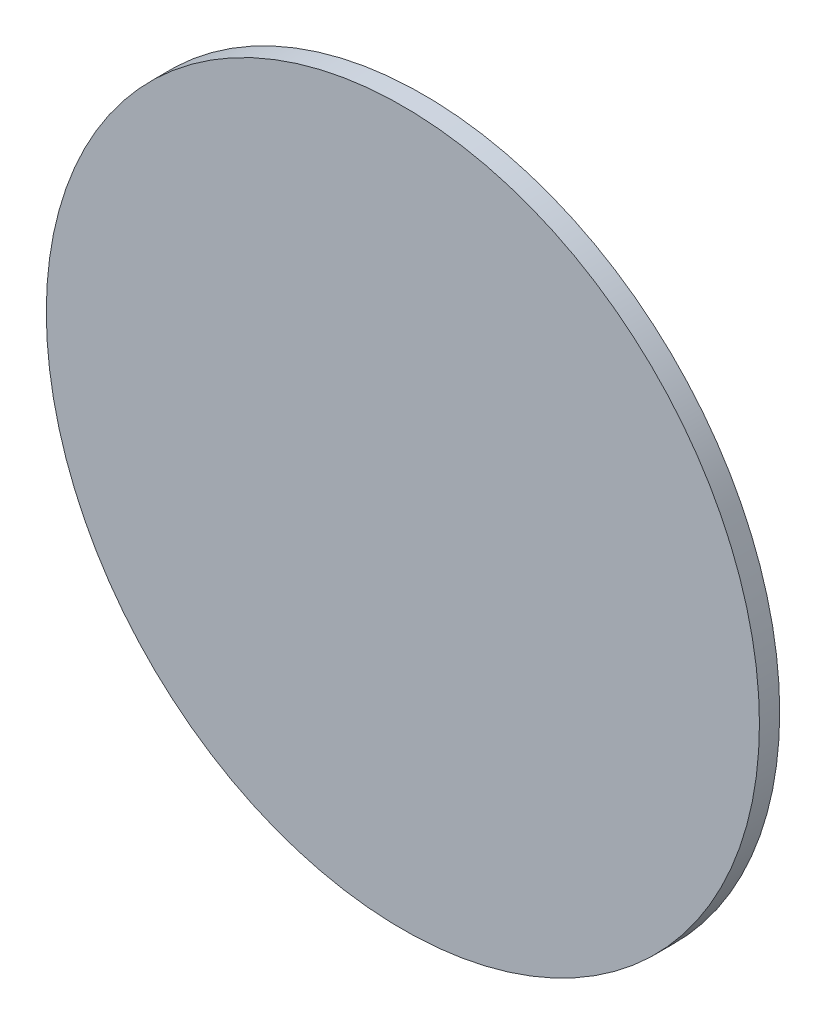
ISO-10303-21;
HEADER;
FILE_DESCRIPTION(('STEP AP214'),'2;1');
FILE_NAME('part.step','',(''),(''),'','','');
FILE_SCHEMA(('AUTOMOTIVE_DESIGN { 1 0 10303 214 1 1 1 1 }'));
ENDSEC;
DATA;
#1=APPLICATION_CONTEXT('core data for automotive mechanical design processes');
#2=APPLICATION_PROTOCOL_DEFINITION('international standard','automotive_design',2000,#1);
#3=PRODUCT_CONTEXT('',#1,'mechanical');
#4=PRODUCT('Part','Part','',(#3));
#5=PRODUCT_RELATED_PRODUCT_CATEGORY('part','',(#4));
#6=PRODUCT_DEFINITION_FORMATION('','',#4);
#7=PRODUCT_DEFINITION_CONTEXT('part definition',#1,'design');
#8=PRODUCT_DEFINITION('design','',#6,#7);
#9=PRODUCT_DEFINITION_SHAPE('','',#8);
#10=(LENGTH_UNIT() NAMED_UNIT(*) SI_UNIT(.MILLI.,.METRE.));
#11=(NAMED_UNIT(*) PLANE_ANGLE_UNIT() SI_UNIT($,.RADIAN.));
#12=(NAMED_UNIT(*) SI_UNIT($,.STERADIAN.) SOLID_ANGLE_UNIT());
#13=UNCERTAINTY_MEASURE_WITH_UNIT(LENGTH_MEASURE(1.E-05),#10,'distance_accuracy_value','');
#14=(GEOMETRIC_REPRESENTATION_CONTEXT(3) GLOBAL_UNCERTAINTY_ASSIGNED_CONTEXT((#13)) GLOBAL_UNIT_ASSIGNED_CONTEXT((#10,
#11,#12)) REPRESENTATION_CONTEXT('',''));
#15=CARTESIAN_POINT('',(0.,0.,0.));
#16=DIRECTION('',(0.,0.,1.));
#17=DIRECTION('',(1.,0.,0.));
#18=AXIS2_PLACEMENT_3D('',#15,#16,#17);
#19=CARTESIAN_POINT('',(0.,0.,5.));
#20=DIRECTION('',(0.,0.,-1.));
#21=DIRECTION('',(-1.,0.,0.));
#22=AXIS2_PLACEMENT_3D('',#19,#20,#21);
#23=CYLINDRICAL_SURFACE('',#22,88.);
#24=CARTESIAN_POINT('',(0.,0.,5.));
#25=DIRECTION('',(0.,0.,1.));
#26=DIRECTION('',(1.,0.,0.));
#27=AXIS2_PLACEMENT_3D('',#24,#25,#26);
#28=CIRCLE('',#27,88.);
#29=CARTESIAN_POINT('',(88.,0.,5.));
#30=VERTEX_POINT('',#29);
#31=EDGE_CURVE('E10',#30,#30,#28,.T.);
#32=ORIENTED_EDGE('',*,*,#31,.F.);
#33=EDGE_LOOP('',(#32));
#34=FACE_BOUND('',#33,.T.);
#35=CARTESIAN_POINT('',(0.,0.,0.));
#36=DIRECTION('',(0.,0.,1.));
#37=DIRECTION('',(1.,0.,0.));
#38=AXIS2_PLACEMENT_3D('',#35,#36,#37);
#39=CIRCLE('',#38,88.);
#40=CARTESIAN_POINT('',(88.,0.,0.));
#41=VERTEX_POINT('',#40);
#42=EDGE_CURVE('E40',#41,#41,#39,.T.);
#43=ORIENTED_EDGE('',*,*,#42,.T.);
#44=EDGE_LOOP('',(#43));
#45=FACE_BOUND('',#44,.T.);
#46=ADVANCED_FACE('F37',(#34,#45),#23,.T.);
#47=CARTESIAN_POINT('',(0.,0.,5.));
#48=DIRECTION('',(0.,0.,1.));
#49=DIRECTION('',(1.,0.,0.));
#50=AXIS2_PLACEMENT_3D('',#47,#48,#49);
#51=PLANE('',#50);
#52=ORIENTED_EDGE('',*,*,#31,.T.);
#53=EDGE_LOOP('',(#52));
#54=FACE_BOUND('',#53,.T.);
#55=ADVANCED_FACE('F52',(#54),#51,.T.);
#56=CARTESIAN_POINT('',(0.,0.,0.));
#57=DIRECTION('',(0.,0.,1.));
#58=DIRECTION('',(1.,0.,0.));
#59=AXIS2_PLACEMENT_3D('',#56,#57,#58);
#60=PLANE('',#59);
#61=ORIENTED_EDGE('',*,*,#42,.F.);
#62=EDGE_LOOP('',(#61));
#63=FACE_BOUND('',#62,.T.);
#64=ADVANCED_FACE('F50',(#63),#60,.F.);
#65=CLOSED_SHELL('',(#46,#55,#64));
#66=MANIFOLD_SOLID_BREP('B2',#65);
#67=ADVANCED_BREP_SHAPE_REPRESENTATION('',(#18,#66),#14);
#68=SHAPE_DEFINITION_REPRESENTATION(#9,#67);
ENDSEC;
END-ISO-10303-21;
